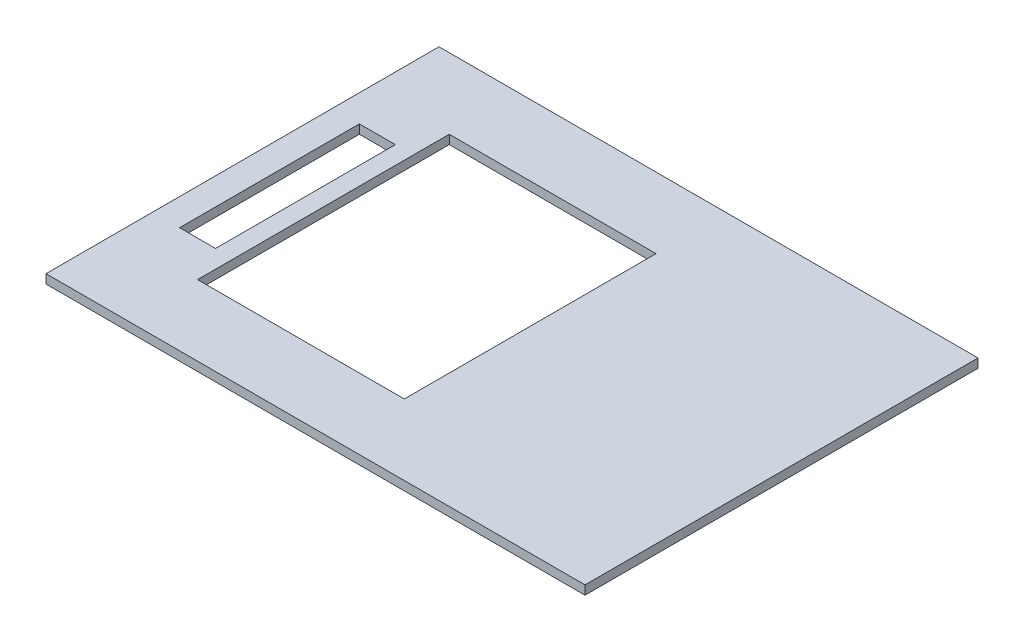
ISO-10303-21;
HEADER;
FILE_DESCRIPTION(('STEP AP214'),'2;1');
FILE_NAME('part.step','',(''),(''),'','','');
FILE_SCHEMA(('AUTOMOTIVE_DESIGN { 1 0 10303 214 1 1 1 1 }'));
ENDSEC;
DATA;
#1=APPLICATION_CONTEXT('core data for automotive mechanical design processes');
#2=APPLICATION_PROTOCOL_DEFINITION('international standard','automotive_design',2000,#1);
#3=PRODUCT_CONTEXT('',#1,'mechanical');
#4=PRODUCT('Part','Part','',(#3));
#5=PRODUCT_RELATED_PRODUCT_CATEGORY('part','',(#4));
#6=PRODUCT_DEFINITION_FORMATION('','',#4);
#7=PRODUCT_DEFINITION_CONTEXT('part definition',#1,'design');
#8=PRODUCT_DEFINITION('design','',#6,#7);
#9=PRODUCT_DEFINITION_SHAPE('','',#8);
#10=(LENGTH_UNIT() NAMED_UNIT(*) SI_UNIT(.MILLI.,.METRE.));
#11=(NAMED_UNIT(*) PLANE_ANGLE_UNIT() SI_UNIT($,.RADIAN.));
#12=(NAMED_UNIT(*) SI_UNIT($,.STERADIAN.) SOLID_ANGLE_UNIT());
#13=UNCERTAINTY_MEASURE_WITH_UNIT(LENGTH_MEASURE(1.E-05),#10,'distance_accuracy_value','');
#14=(GEOMETRIC_REPRESENTATION_CONTEXT(3) GLOBAL_UNCERTAINTY_ASSIGNED_CONTEXT((#13)) GLOBAL_UNIT_ASSIGNED_CONTEXT((#10,
#11,#12)) REPRESENTATION_CONTEXT('',''));
#15=CARTESIAN_POINT('',(0.,0.,0.));
#16=DIRECTION('',(0.,0.,1.));
#17=DIRECTION('',(1.,0.,0.));
#18=AXIS2_PLACEMENT_3D('',#15,#16,#17);
#19=CARTESIAN_POINT('',(149.9,5.,109.3));
#20=DIRECTION('',(-1.,0.,0.));
#21=DIRECTION('',(0.,0.,1.));
#22=AXIS2_PLACEMENT_3D('',#19,#20,#21);
#23=PLANE('',#22);
#24=DIRECTION('',(0.,0.,-1.));
#25=VECTOR('',#24,1.);
#26=CARTESIAN_POINT('',(149.9,0.,109.3));
#27=LINE('',#26,#25);
#28=CARTESIAN_POINT('',(149.9,0.,109.3));
#29=VERTEX_POINT('',#28);
#30=CARTESIAN_POINT('',(149.9,0.,-109.3));
#31=VERTEX_POINT('',#30);
#32=EDGE_CURVE('E180',#29,#31,#27,.T.);
#33=ORIENTED_EDGE('',*,*,#32,.T.);
#34=DIRECTION('',(0.,-1.,0.));
#35=VECTOR('',#34,1.);
#36=CARTESIAN_POINT('',(149.9,5.,-109.3));
#37=LINE('',#36,#35);
#38=CARTESIAN_POINT('',(149.9,5.,-109.3));
#39=VERTEX_POINT('',#38);
#40=EDGE_CURVE('E213',#39,#31,#37,.T.);
#41=ORIENTED_EDGE('',*,*,#40,.F.);
#42=DIRECTION('',(0.,0.,-1.));
#43=VECTOR('',#42,1.);
#44=CARTESIAN_POINT('',(149.9,5.,109.3));
#45=LINE('',#44,#43);
#46=CARTESIAN_POINT('',(149.9,5.,109.3));
#47=VERTEX_POINT('',#46);
#48=EDGE_CURVE('E187',#47,#39,#45,.T.);
#49=ORIENTED_EDGE('',*,*,#48,.F.);
#50=DIRECTION('',(0.,-1.,0.));
#51=VECTOR('',#50,1.);
#52=CARTESIAN_POINT('',(149.9,5.,109.3));
#53=LINE('',#52,#51);
#54=EDGE_CURVE('E197',#47,#29,#53,.T.);
#55=ORIENTED_EDGE('',*,*,#54,.T.);
#56=EDGE_LOOP('',(#33,#41,#49,#55));
#57=FACE_BOUND('',#56,.T.);
#58=ADVANCED_FACE('F39',(#57),#23,.F.);
#59=CARTESIAN_POINT('',(-149.9,5.,-109.3));
#60=DIRECTION('',(0.,0.,1.));
#61=DIRECTION('',(1.,0.,0.));
#62=AXIS2_PLACEMENT_3D('',#59,#60,#61);
#63=PLANE('',#62);
#64=DIRECTION('',(-1.,0.,0.));
#65=VECTOR('',#64,1.);
#66=CARTESIAN_POINT('',(-149.9,0.,-109.3));
#67=LINE('',#66,#65);
#68=CARTESIAN_POINT('',(-149.9,0.,-109.3));
#69=VERTEX_POINT('',#68);
#70=EDGE_CURVE('E200',#31,#69,#67,.T.);
#71=ORIENTED_EDGE('',*,*,#70,.T.);
#72=DIRECTION('',(0.,-1.,0.));
#73=VECTOR('',#72,1.);
#74=CARTESIAN_POINT('',(-149.9,5.,-109.3));
#75=LINE('',#74,#73);
#76=CARTESIAN_POINT('',(-149.9,5.,-109.3));
#77=VERTEX_POINT('',#76);
#78=EDGE_CURVE('E210',#77,#69,#75,.T.);
#79=ORIENTED_EDGE('',*,*,#78,.F.);
#80=DIRECTION('',(-1.,0.,0.));
#81=VECTOR('',#80,1.);
#82=CARTESIAN_POINT('',(-149.9,5.,-109.3));
#83=LINE('',#82,#81);
#84=EDGE_CURVE('E190',#39,#77,#83,.T.);
#85=ORIENTED_EDGE('',*,*,#84,.F.);
#86=ORIENTED_EDGE('',*,*,#40,.T.);
#87=EDGE_LOOP('',(#71,#79,#85,#86));
#88=FACE_BOUND('',#87,.T.);
#89=ADVANCED_FACE('F242',(#88),#63,.F.);
#90=CARTESIAN_POINT('',(-149.9,5.,109.3));
#91=DIRECTION('',(1.,0.,0.));
#92=DIRECTION('',(0.,0.,-1.));
#93=AXIS2_PLACEMENT_3D('',#90,#91,#92);
#94=PLANE('',#93);
#95=DIRECTION('',(0.,0.,1.));
#96=VECTOR('',#95,1.);
#97=CARTESIAN_POINT('',(-149.9,0.,109.3));
#98=LINE('',#97,#96);
#99=CARTESIAN_POINT('',(-149.9,0.,109.3));
#100=VERTEX_POINT('',#99);
#101=EDGE_CURVE('E202',#69,#100,#98,.T.);
#102=ORIENTED_EDGE('',*,*,#101,.T.);
#103=DIRECTION('',(0.,-1.,0.));
#104=VECTOR('',#103,1.);
#105=CARTESIAN_POINT('',(-149.9,5.,109.3));
#106=LINE('',#105,#104);
#107=CARTESIAN_POINT('',(-149.9,5.,109.3));
#108=VERTEX_POINT('',#107);
#109=EDGE_CURVE('E207',#108,#100,#106,.T.);
#110=ORIENTED_EDGE('',*,*,#109,.F.);
#111=DIRECTION('',(0.,0.,1.));
#112=VECTOR('',#111,1.);
#113=CARTESIAN_POINT('',(-149.9,5.,109.3));
#114=LINE('',#113,#112);
#115=EDGE_CURVE('E193',#77,#108,#114,.T.);
#116=ORIENTED_EDGE('',*,*,#115,.F.);
#117=ORIENTED_EDGE('',*,*,#78,.T.);
#118=EDGE_LOOP('',(#102,#110,#116,#117));
#119=FACE_BOUND('',#118,.T.);
#120=ADVANCED_FACE('F247',(#119),#94,.F.);
#121=CARTESIAN_POINT('',(-149.9,5.,109.3));
#122=DIRECTION('',(0.,0.,-1.));
#123=DIRECTION('',(-1.,0.,0.));
#124=AXIS2_PLACEMENT_3D('',#121,#122,#123);
#125=PLANE('',#124);
#126=DIRECTION('',(1.,0.,0.));
#127=VECTOR('',#126,1.);
#128=CARTESIAN_POINT('',(-149.9,0.,109.3));
#129=LINE('',#128,#127);
#130=EDGE_CURVE('E191',#100,#29,#129,.T.);
#131=ORIENTED_EDGE('',*,*,#130,.T.);
#132=ORIENTED_EDGE('',*,*,#54,.F.);
#133=DIRECTION('',(1.,0.,0.));
#134=VECTOR('',#133,1.);
#135=CARTESIAN_POINT('',(-149.9,5.,109.3));
#136=LINE('',#135,#134);
#137=EDGE_CURVE('E195',#108,#47,#136,.T.);
#138=ORIENTED_EDGE('',*,*,#137,.F.);
#139=ORIENTED_EDGE('',*,*,#109,.T.);
#140=EDGE_LOOP('',(#131,#132,#138,#139));
#141=FACE_BOUND('',#140,.T.);
#142=ADVANCED_FACE('F262',(#141),#125,.F.);
#143=CARTESIAN_POINT('',(0.,5.,0.));
#144=DIRECTION('',(0.,-1.,0.));
#145=DIRECTION('',(0.,0.,-1.));
#146=AXIS2_PLACEMENT_3D('',#143,#144,#145);
#147=PLANE('',#146);
#148=DIRECTION('',(1.,0.,0.));
#149=VECTOR('',#148,1.);
#150=CARTESIAN_POINT('',(-104.9,5.,70.));
#151=LINE('',#150,#149);
#152=CARTESIAN_POINT('',(-104.9,5.,70.));
#153=VERTEX_POINT('',#152);
#154=CARTESIAN_POINT('',(10.1,5.,70.));
#155=VERTEX_POINT('',#154);
#156=EDGE_CURVE('E138',#153,#155,#151,.T.);
#157=ORIENTED_EDGE('',*,*,#156,.F.);
#158=DIRECTION('',(0.,0.,1.));
#159=VECTOR('',#158,1.);
#160=CARTESIAN_POINT('',(-104.9,5.,-70.));
#161=LINE('',#160,#159);
#162=CARTESIAN_POINT('',(-104.9,5.,-70.));
#163=VERTEX_POINT('',#162);
#164=EDGE_CURVE('E53',#163,#153,#161,.T.);
#165=ORIENTED_EDGE('',*,*,#164,.F.);
#166=DIRECTION('',(-1.,0.,0.));
#167=VECTOR('',#166,1.);
#168=CARTESIAN_POINT('',(-104.9,5.,-70.));
#169=LINE('',#168,#167);
#170=CARTESIAN_POINT('',(10.1,5.,-70.));
#171=VERTEX_POINT('',#170);
#172=EDGE_CURVE('E145',#171,#163,#169,.T.);
#173=ORIENTED_EDGE('',*,*,#172,.F.);
#174=DIRECTION('',(0.,0.,-1.));
#175=VECTOR('',#174,1.);
#176=CARTESIAN_POINT('',(10.1,5.,-70.));
#177=LINE('',#176,#175);
#178=EDGE_CURVE('E129',#155,#171,#177,.T.);
#179=ORIENTED_EDGE('',*,*,#178,.F.);
#180=EDGE_LOOP('',(#157,#165,#173,#179));
#181=FACE_BOUND('',#180,.T.);
#182=DIRECTION('',(-1.,0.,0.));
#183=VECTOR('',#182,1.);
#184=CARTESIAN_POINT('',(-134.9,5.,-50.));
#185=LINE('',#184,#183);
#186=CARTESIAN_POINT('',(-114.9,5.,-50.));
#187=VERTEX_POINT('',#186);
#188=CARTESIAN_POINT('',(-134.9,5.,-50.));
#189=VERTEX_POINT('',#188);
#190=EDGE_CURVE('E170',#187,#189,#185,.T.);
#191=ORIENTED_EDGE('',*,*,#190,.F.);
#192=DIRECTION('',(0.,0.,-1.));
#193=VECTOR('',#192,1.);
#194=CARTESIAN_POINT('',(-114.9,5.,50.));
#195=LINE('',#194,#193);
#196=CARTESIAN_POINT('',(-114.9,5.,50.));
#197=VERTEX_POINT('',#196);
#198=EDGE_CURVE('E152',#197,#187,#195,.T.);
#199=ORIENTED_EDGE('',*,*,#198,.F.);
#200=DIRECTION('',(1.,0.,0.));
#201=VECTOR('',#200,1.);
#202=CARTESIAN_POINT('',(-134.9,5.,50.));
#203=LINE('',#202,#201);
#204=CARTESIAN_POINT('',(-134.9,5.,50.));
#205=VERTEX_POINT('',#204);
#206=EDGE_CURVE('E159',#205,#197,#203,.T.);
#207=ORIENTED_EDGE('',*,*,#206,.F.);
#208=DIRECTION('',(0.,0.,1.));
#209=VECTOR('',#208,1.);
#210=CARTESIAN_POINT('',(-134.9,5.,50.));
#211=LINE('',#210,#209);
#212=EDGE_CURVE('E173',#189,#205,#211,.T.);
#213=ORIENTED_EDGE('',*,*,#212,.F.);
#214=EDGE_LOOP('',(#191,#199,#207,#213));
#215=FACE_BOUND('',#214,.T.);
#216=ORIENTED_EDGE('',*,*,#48,.T.);
#217=ORIENTED_EDGE('',*,*,#84,.T.);
#218=ORIENTED_EDGE('',*,*,#115,.T.);
#219=ORIENTED_EDGE('',*,*,#137,.T.);
#220=EDGE_LOOP('',(#216,#217,#218,#219));
#221=FACE_BOUND('',#220,.T.);
#222=ADVANCED_FACE('F142',(#181,#215,#221),#147,.F.);
#223=CARTESIAN_POINT('',(0.,0.,0.));
#224=DIRECTION('',(0.,-1.,0.));
#225=DIRECTION('',(0.,0.,-1.));
#226=AXIS2_PLACEMENT_3D('',#223,#224,#225);
#227=PLANE('',#226);
#228=DIRECTION('',(0.,0.,-1.));
#229=VECTOR('',#228,1.);
#230=CARTESIAN_POINT('',(-104.9,0.,0.));
#231=LINE('',#230,#229);
#232=CARTESIAN_POINT('',(-104.9,0.,70.));
#233=VERTEX_POINT('',#232);
#234=CARTESIAN_POINT('',(-104.9,0.,-70.));
#235=VERTEX_POINT('',#234);
#236=EDGE_CURVE('E11',#233,#235,#231,.T.);
#237=ORIENTED_EDGE('',*,*,#236,.F.);
#238=DIRECTION('',(-1.,0.,0.));
#239=VECTOR('',#238,1.);
#240=CARTESIAN_POINT('',(0.,0.,70.));
#241=LINE('',#240,#239);
#242=CARTESIAN_POINT('',(10.1,0.,70.));
#243=VERTEX_POINT('',#242);
#244=EDGE_CURVE('E216',#243,#233,#241,.T.);
#245=ORIENTED_EDGE('',*,*,#244,.F.);
#246=DIRECTION('',(0.,0.,1.));
#247=VECTOR('',#246,1.);
#248=CARTESIAN_POINT('',(10.1,0.,0.));
#249=LINE('',#248,#247);
#250=CARTESIAN_POINT('',(10.1,0.,-70.));
#251=VERTEX_POINT('',#250);
#252=EDGE_CURVE('E132',#251,#243,#249,.T.);
#253=ORIENTED_EDGE('',*,*,#252,.F.);
#254=DIRECTION('',(1.,0.,0.));
#255=VECTOR('',#254,1.);
#256=CARTESIAN_POINT('',(0.,0.,-70.));
#257=LINE('',#256,#255);
#258=EDGE_CURVE('E46',#235,#251,#257,.T.);
#259=ORIENTED_EDGE('',*,*,#258,.F.);
#260=EDGE_LOOP('',(#237,#245,#253,#259));
#261=FACE_BOUND('',#260,.T.);
#262=DIRECTION('',(0.,0.,-1.));
#263=VECTOR('',#262,1.);
#264=CARTESIAN_POINT('',(-114.9,0.,50.));
#265=LINE('',#264,#263);
#266=CARTESIAN_POINT('',(-114.9,0.,50.));
#267=VERTEX_POINT('',#266);
#268=CARTESIAN_POINT('',(-114.9,0.,-50.));
#269=VERTEX_POINT('',#268);
#270=EDGE_CURVE('E155',#267,#269,#265,.T.);
#271=ORIENTED_EDGE('',*,*,#270,.T.);
#272=DIRECTION('',(-1.,0.,0.));
#273=VECTOR('',#272,1.);
#274=CARTESIAN_POINT('',(-134.9,0.,-50.));
#275=LINE('',#274,#273);
#276=CARTESIAN_POINT('',(-134.9,0.,-50.));
#277=VERTEX_POINT('',#276);
#278=EDGE_CURVE('E158',#269,#277,#275,.T.);
#279=ORIENTED_EDGE('',*,*,#278,.T.);
#280=DIRECTION('',(0.,0.,1.));
#281=VECTOR('',#280,1.);
#282=CARTESIAN_POINT('',(-134.9,0.,50.));
#283=LINE('',#282,#281);
#284=CARTESIAN_POINT('',(-134.9,0.,50.));
#285=VERTEX_POINT('',#284);
#286=EDGE_CURVE('E162',#277,#285,#283,.T.);
#287=ORIENTED_EDGE('',*,*,#286,.T.);
#288=DIRECTION('',(1.,0.,0.));
#289=VECTOR('',#288,1.);
#290=CARTESIAN_POINT('',(-134.9,0.,50.));
#291=LINE('',#290,#289);
#292=EDGE_CURVE('E165',#285,#267,#291,.T.);
#293=ORIENTED_EDGE('',*,*,#292,.T.);
#294=EDGE_LOOP('',(#271,#279,#287,#293));
#295=FACE_BOUND('',#294,.T.);
#296=ORIENTED_EDGE('',*,*,#32,.F.);
#297=ORIENTED_EDGE('',*,*,#130,.F.);
#298=ORIENTED_EDGE('',*,*,#101,.F.);
#299=ORIENTED_EDGE('',*,*,#70,.F.);
#300=EDGE_LOOP('',(#296,#297,#298,#299));
#301=FACE_BOUND('',#300,.T.);
#302=ADVANCED_FACE('F224',(#261,#295,#301),#227,.T.);
#303=CARTESIAN_POINT('',(-114.9,0.,50.));
#304=DIRECTION('',(1.,0.,0.));
#305=DIRECTION('',(0.,0.,-1.));
#306=AXIS2_PLACEMENT_3D('',#303,#304,#305);
#307=PLANE('',#306);
#308=ORIENTED_EDGE('',*,*,#198,.T.);
#309=DIRECTION('',(0.,1.,0.));
#310=VECTOR('',#309,1.);
#311=CARTESIAN_POINT('',(-114.9,0.,-50.));
#312=LINE('',#311,#310);
#313=EDGE_CURVE('E168',#269,#187,#312,.T.);
#314=ORIENTED_EDGE('',*,*,#313,.F.);
#315=ORIENTED_EDGE('',*,*,#270,.F.);
#316=DIRECTION('',(0.,1.,0.));
#317=VECTOR('',#316,1.);
#318=CARTESIAN_POINT('',(-114.9,0.,50.));
#319=LINE('',#318,#317);
#320=EDGE_CURVE('E178',#267,#197,#319,.T.);
#321=ORIENTED_EDGE('',*,*,#320,.T.);
#322=EDGE_LOOP('',(#308,#314,#315,#321));
#323=FACE_BOUND('',#322,.T.);
#324=ADVANCED_FACE('F272',(#323),#307,.F.);
#325=CARTESIAN_POINT('',(-134.9,0.,50.));
#326=DIRECTION('',(0.,0.,1.));
#327=DIRECTION('',(1.,0.,0.));
#328=AXIS2_PLACEMENT_3D('',#325,#326,#327);
#329=PLANE('',#328);
#330=ORIENTED_EDGE('',*,*,#206,.T.);
#331=ORIENTED_EDGE('',*,*,#320,.F.);
#332=ORIENTED_EDGE('',*,*,#292,.F.);
#333=DIRECTION('',(0.,1.,0.));
#334=VECTOR('',#333,1.);
#335=CARTESIAN_POINT('',(-134.9,0.,50.));
#336=LINE('',#335,#334);
#337=EDGE_CURVE('E181',#285,#205,#336,.T.);
#338=ORIENTED_EDGE('',*,*,#337,.T.);
#339=EDGE_LOOP('',(#330,#331,#332,#338));
#340=FACE_BOUND('',#339,.T.);
#341=ADVANCED_FACE('F276',(#340),#329,.F.);
#342=CARTESIAN_POINT('',(-134.9,0.,50.));
#343=DIRECTION('',(-1.,0.,0.));
#344=DIRECTION('',(0.,0.,1.));
#345=AXIS2_PLACEMENT_3D('',#342,#343,#344);
#346=PLANE('',#345);
#347=ORIENTED_EDGE('',*,*,#212,.T.);
#348=ORIENTED_EDGE('',*,*,#337,.F.);
#349=ORIENTED_EDGE('',*,*,#286,.F.);
#350=DIRECTION('',(0.,1.,0.));
#351=VECTOR('',#350,1.);
#352=CARTESIAN_POINT('',(-134.9,0.,-50.));
#353=LINE('',#352,#351);
#354=EDGE_CURVE('E183',#277,#189,#353,.T.);
#355=ORIENTED_EDGE('',*,*,#354,.T.);
#356=EDGE_LOOP('',(#347,#348,#349,#355));
#357=FACE_BOUND('',#356,.T.);
#358=ADVANCED_FACE('F236',(#357),#346,.F.);
#359=CARTESIAN_POINT('',(-134.9,0.,-50.));
#360=DIRECTION('',(0.,0.,-1.));
#361=DIRECTION('',(-1.,0.,0.));
#362=AXIS2_PLACEMENT_3D('',#359,#360,#361);
#363=PLANE('',#362);
#364=ORIENTED_EDGE('',*,*,#190,.T.);
#365=ORIENTED_EDGE('',*,*,#354,.F.);
#366=ORIENTED_EDGE('',*,*,#278,.F.);
#367=ORIENTED_EDGE('',*,*,#313,.T.);
#368=EDGE_LOOP('',(#364,#365,#366,#367));
#369=FACE_BOUND('',#368,.T.);
#370=ADVANCED_FACE('F228',(#369),#363,.F.);
#371=CARTESIAN_POINT('',(-104.9,-5.,-70.));
#372=DIRECTION('',(-1.,0.,0.));
#373=DIRECTION('',(0.,0.,1.));
#374=AXIS2_PLACEMENT_3D('',#371,#372,#373);
#375=PLANE('',#374);
#376=ORIENTED_EDGE('',*,*,#236,.T.);
#377=DIRECTION('',(0.,1.,0.));
#378=VECTOR('',#377,1.);
#379=CARTESIAN_POINT('',(-104.9,-5.,-70.));
#380=LINE('',#379,#378);
#381=EDGE_CURVE('E150',#235,#163,#380,.T.);
#382=ORIENTED_EDGE('',*,*,#381,.T.);
#383=ORIENTED_EDGE('',*,*,#164,.T.);
#384=DIRECTION('',(0.,1.,0.));
#385=VECTOR('',#384,1.);
#386=CARTESIAN_POINT('',(-104.9,-5.,70.));
#387=LINE('',#386,#385);
#388=EDGE_CURVE('E135',#233,#153,#387,.T.);
#389=ORIENTED_EDGE('',*,*,#388,.F.);
#390=EDGE_LOOP('',(#376,#382,#383,#389));
#391=FACE_BOUND('',#390,.T.);
#392=ADVANCED_FACE('F226',(#391),#375,.F.);
#393=CARTESIAN_POINT('',(-104.9,-5.,-70.));
#394=DIRECTION('',(0.,0.,-1.));
#395=DIRECTION('',(-1.,0.,0.));
#396=AXIS2_PLACEMENT_3D('',#393,#394,#395);
#397=PLANE('',#396);
#398=ORIENTED_EDGE('',*,*,#258,.T.);
#399=DIRECTION('',(0.,1.,0.));
#400=VECTOR('',#399,1.);
#401=CARTESIAN_POINT('',(10.1,-5.,-70.));
#402=LINE('',#401,#400);
#403=EDGE_CURVE('E134',#251,#171,#402,.T.);
#404=ORIENTED_EDGE('',*,*,#403,.T.);
#405=ORIENTED_EDGE('',*,*,#172,.T.);
#406=ORIENTED_EDGE('',*,*,#381,.F.);
#407=EDGE_LOOP('',(#398,#404,#405,#406));
#408=FACE_BOUND('',#407,.T.);
#409=ADVANCED_FACE('F221',(#408),#397,.F.);
#410=CARTESIAN_POINT('',(10.1,-5.,-70.));
#411=DIRECTION('',(1.,0.,0.));
#412=DIRECTION('',(0.,0.,-1.));
#413=AXIS2_PLACEMENT_3D('',#410,#411,#412);
#414=PLANE('',#413);
#415=ORIENTED_EDGE('',*,*,#252,.T.);
#416=DIRECTION('',(0.,1.,0.));
#417=VECTOR('',#416,1.);
#418=CARTESIAN_POINT('',(10.1,-5.,70.));
#419=LINE('',#418,#417);
#420=EDGE_CURVE('E61',#243,#155,#419,.T.);
#421=ORIENTED_EDGE('',*,*,#420,.T.);
#422=ORIENTED_EDGE('',*,*,#178,.T.);
#423=ORIENTED_EDGE('',*,*,#403,.F.);
#424=EDGE_LOOP('',(#415,#421,#422,#423));
#425=FACE_BOUND('',#424,.T.);
#426=ADVANCED_FACE('F126',(#425),#414,.F.);
#427=CARTESIAN_POINT('',(-104.9,-5.,70.));
#428=DIRECTION('',(0.,0.,1.));
#429=DIRECTION('',(1.,0.,0.));
#430=AXIS2_PLACEMENT_3D('',#427,#428,#429);
#431=PLANE('',#430);
#432=ORIENTED_EDGE('',*,*,#244,.T.);
#433=ORIENTED_EDGE('',*,*,#388,.T.);
#434=ORIENTED_EDGE('',*,*,#156,.T.);
#435=ORIENTED_EDGE('',*,*,#420,.F.);
#436=EDGE_LOOP('',(#432,#433,#434,#435));
#437=FACE_BOUND('',#436,.T.);
#438=ADVANCED_FACE('F139',(#437),#431,.F.);
#439=CLOSED_SHELL('',(#58,#89,#120,#142,#222,#302,#324,#341,#358,#370,#392,#409,#426,#438));
#440=MANIFOLD_SOLID_BREP('B2',#439);
#441=ADVANCED_BREP_SHAPE_REPRESENTATION('',(#18,#440),#14);
#442=SHAPE_DEFINITION_REPRESENTATION(#9,#441);
ENDSEC;
END-ISO-10303-21;
